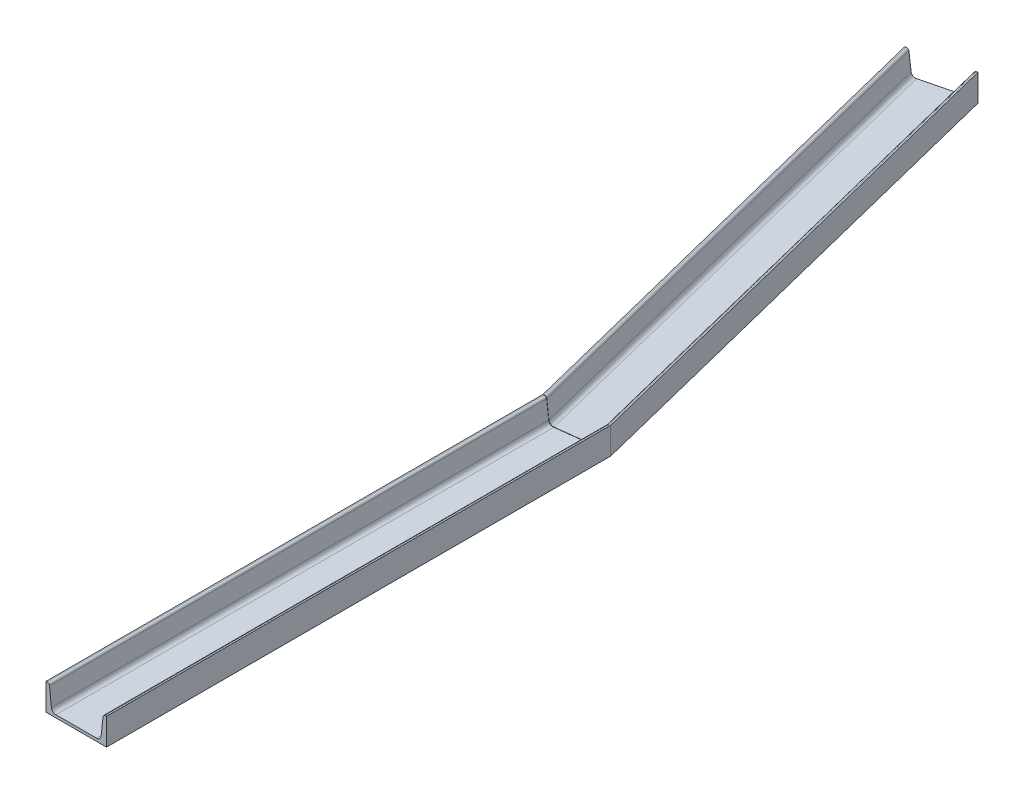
from build123d import *

# Parameters (mm, degrees)
EXTRUDE_1_DEPTH     = 1000
EXTRUDE_6_DEPTH     = 1000
CUT_EXTRUDE_4_DEPTH = 1000
CUT_EXTRUDE_5_REACH = 1981.551
CUT_EXTRUDE_START   = -987.428324
CUT_EXTRUDE_6_DEPTH = 16.458951


with BuildPart() as part:
    # Sketch 1 → Extrude 1 (new body)
    with BuildSketch(Plane.XY):
        with BuildLine():
            Line((-60, 0), (60, 0))
            Line((60, 0), (60, 53))
            Line((60, 53), (57.551177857, 53))
            ThreePointArc((57.551177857, 53), (54.540352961, 51.844388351), (53.075903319, 48.97108153))
            Line((53.075903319, 48.97108153), (49.348193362, 13.557836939))
            ThreePointArc((49.348193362, 13.557836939), (46.419294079, 7.811223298), (40.397644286, 5.5))
            Line((40.397644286, 5.5), (-40.397644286, 5.5))
            ThreePointArc((-40.397644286, 5.5), (-46.419294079, 7.811223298), (-49.348193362, 13.557836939))
            Line((-49.348193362, 13.557836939), (-53.075903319, 48.97108153))
            ThreePointArc((-53.075903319, 48.97108153), (-54.540352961, 51.844388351), (-57.551177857, 53))
            Line((-57.551177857, 53), (-60, 53))
            Line((-60, 53), (-60, 0))
        make_face()
    extrude(amount=EXTRUDE_1_DEPTH)

    # Sketch 11 → Extrude 6 (add)
    with BuildSketch(Plane(origin=(3.511572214, 0, 14.084146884), x_dir=(-0.9702957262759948, 0, 0.2419218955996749), z_dir=(-0.2419218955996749, 0, -0.9702957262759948))):
        with BuildLine():
            Line((-58.217743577, 0), (-58.217743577, 53))
            Line((-58.217743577, 53), (-55.768921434, 53))
            ThreePointArc((-55.768921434, 53), (-52.758096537, 51.844388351), (-51.293646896, 48.97108153))
            Line((-51.293646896, 48.97108153), (-47.565936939, 13.557836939))
            ThreePointArc((-47.565936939, 13.557836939), (-44.637037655, 7.811223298), (-38.615387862, 5.5))
            Line((-38.615387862, 5.5), (42.179900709, 5.5))
            ThreePointArc((42.179900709, 5.5), (48.201550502, 7.811223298), (51.130449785, 13.557836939))
            Line((51.130449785, 13.557836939), (54.858159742, 48.97108153))
            ThreePointArc((54.858159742, 48.97108153), (56.322609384, 51.844388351), (59.333434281, 53))
            Line((59.333434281, 53), (61.782256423, 53))
            Line((61.782256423, 53), (61.782256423, 0))
            Line((61.782256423, 0), (-58.217743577, 0))
        make_face()
    extrude(amount=EXTRUDE_6_DEPTH)

    # Sketch 12 → Cut-Extrude 4 (cut)
    with BuildSketch(Plane.XZ):
        Polygon((-77.831531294, 17.175461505), (55.506285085, 0.803636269), (55.445350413, 0.307363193), (-77.831531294, 16.671706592), align=None)
    extrude(amount=-CUT_EXTRUDE_4_DEPTH, mode=Mode.SUBTRACT)

    # Cut-Extrude 5: up to this plane
    cut_extrude_5_end = Plane(origin=(55.445350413, 1000, 0.307363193), z_dir=(-0.12186934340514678, 0, -0.9925461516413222))
    # Sketch 13 → Cut-Extrude 5 (cut, up to the surface)
    with BuildSketch(Plane(origin=(-238.410323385, 0, -956.211579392), x_dir=(-0.9702957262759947, 0, 0.24192189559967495), z_dir=(-0.24192189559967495, 0, -0.9702957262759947)), mode=Mode.PRIVATE) as cut_extrude_5_sk1:
        with BuildLine():
            Line((-55.768921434, 53), (59.333434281, 53))
            ThreePointArc((59.333434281, 53), (56.322609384, 51.844388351), (54.858159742, 48.97108153))
            Line((54.858159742, 48.97108153), (51.130449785, 13.557836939))
            ThreePointArc((51.130449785, 13.557836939), (48.201550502, 7.811223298), (42.179900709, 5.5))
            Line((42.179900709, 5.5), (-38.615387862, 5.5))
            ThreePointArc((-38.615387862, 5.5), (-44.637037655, 7.811223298), (-47.565936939, 13.557836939))
            Line((-47.565936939, 13.557836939), (-51.293646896, 48.97108153))
            ThreePointArc((-51.293646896, 48.97108153), (-52.758096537, 51.844388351), (-55.768921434, 53))
        make_face()
    cut_extrude_5_tool1 = split(extrude(cut_extrude_5_sk1.sketch, amount=-CUT_EXTRUDE_5_REACH, mode=Mode.PRIVATE), bisect_by=cut_extrude_5_end, keep=Keep.BOTH, mode=Mode.PRIVATE)
    add(cut_extrude_5_tool1.solids().sort_by_distance((-240.139639, 29.795271, -955.780413))[0], mode=Mode.SUBTRACT)

    # Sketch 14 → Cut-Extrude 6 (cut)
    with BuildSketch(Plane.XY.offset(1000).offset(CUT_EXTRUDE_START)):
        with BuildLine():
            Line((-57.551177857, 53), (57.551177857, 53))
            ThreePointArc((57.551177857, 53), (54.540352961, 51.844388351), (53.075903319, 48.97108153))
            Line((53.075903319, 48.97108153), (49.348193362, 13.557836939))
            ThreePointArc((49.348193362, 13.557836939), (46.419294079, 7.811223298), (40.397644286, 5.5))
            Line((40.397644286, 5.5), (-40.397644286, 5.5))
            ThreePointArc((-40.397644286, 5.5), (-46.419294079, 7.811223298), (-49.348193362, 13.557836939))
            Line((-49.348193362, 13.557836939), (-53.075903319, 48.97108153))
            ThreePointArc((-53.075903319, 48.97108153), (-54.540352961, 51.844388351), (-57.551177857, 53))
        make_face()
    extrude(amount=CUT_EXTRUDE_6_DEPTH, mode=Mode.SUBTRACT)


solid = part.part
